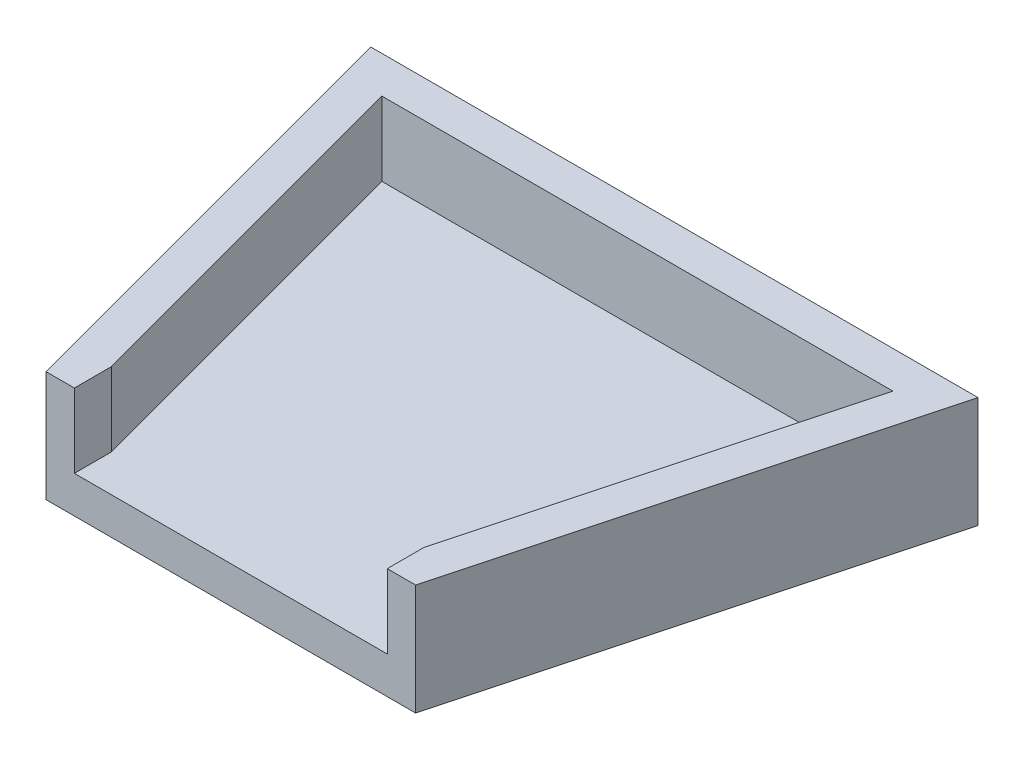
from build123d import *

# Parameters (mm, degrees)
SKETCH1_W           = 100
SKETCH1_H           = 120
BOSS_EXTRUDE1_DEPTH = 30
SHELL1_T            = -10
CUT_EXTRUDE1_START  = -20
SKETCH2_W           = 84.65346024
SKETCH2_H           = 10
CUT_EXTRUDE1_DEPTH  = 20


with BuildPart() as part:
    # Sketch1 → Boss-Extrude1 (new body)
    with BuildSketch(Plane(origin=(0, 0, 0), x_dir=(1, 0, 0), z_dir=(0, 1, 0))):
        Polygon((-82.153903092, 60), (-50, -60), (-50, 60), align=None)
        Rectangle(SKETCH1_W, SKETCH1_H)
        Polygon((50, 60), (50, -60), (82.153903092, 60), align=None)
    extrude(amount=BOSS_EXTRUDE1_DEPTH)

    # Shell1
    shell1_openings = [part.faces().sort_by_distance(p)[0] for p in [
        (0, 30, -4.86612992),
    ]]
    offset(amount=SHELL1_T, openings=shell1_openings, kind=Kind.INTERSECTION)

    # Sketch2 → Cut-Extrude1 (cut)
    with BuildSketch(Plane(origin=(0, 30, 0), x_dir=(1, 0, 0), z_dir=(0, 1, 0)).offset(CUT_EXTRUDE1_START)):
        with Locations((0, -55)):
            Rectangle(SKETCH2_W, SKETCH2_H)
    extrude(amount=CUT_EXTRUDE1_DEPTH, mode=Mode.SUBTRACT)


solid = part.part
